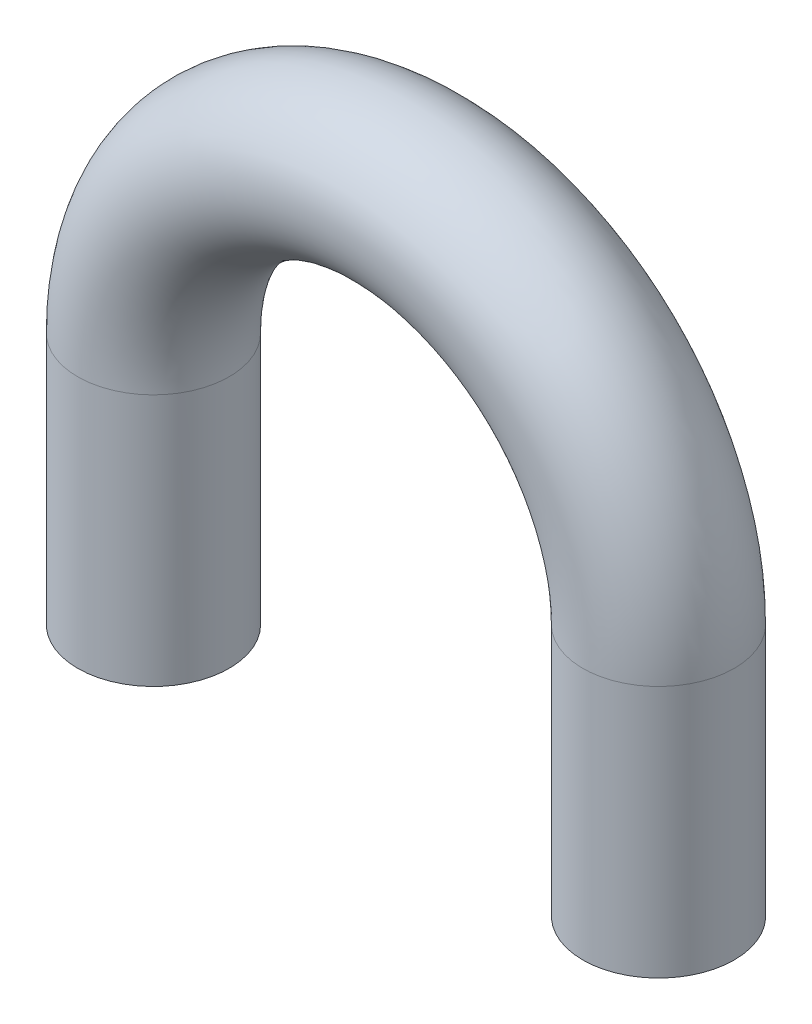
ISO-10303-21;
HEADER;
FILE_DESCRIPTION(('STEP AP214'),'2;1');
FILE_NAME('part.step','',(''),(''),'','','');
FILE_SCHEMA(('AUTOMOTIVE_DESIGN { 1 0 10303 214 1 1 1 1 }'));
ENDSEC;
DATA;
#1=APPLICATION_CONTEXT('core data for automotive mechanical design processes');
#2=APPLICATION_PROTOCOL_DEFINITION('international standard','automotive_design',2000,#1);
#3=PRODUCT_CONTEXT('',#1,'mechanical');
#4=PRODUCT('Part','Part','',(#3));
#5=PRODUCT_RELATED_PRODUCT_CATEGORY('part','',(#4));
#6=PRODUCT_DEFINITION_FORMATION('','',#4);
#7=PRODUCT_DEFINITION_CONTEXT('part definition',#1,'design');
#8=PRODUCT_DEFINITION('design','',#6,#7);
#9=PRODUCT_DEFINITION_SHAPE('','',#8);
#10=(LENGTH_UNIT() NAMED_UNIT(*) SI_UNIT(.MILLI.,.METRE.));
#11=(NAMED_UNIT(*) PLANE_ANGLE_UNIT() SI_UNIT($,.RADIAN.));
#12=(NAMED_UNIT(*) SI_UNIT($,.STERADIAN.) SOLID_ANGLE_UNIT());
#13=UNCERTAINTY_MEASURE_WITH_UNIT(LENGTH_MEASURE(1.E-05),#10,'distance_accuracy_value','');
#14=(GEOMETRIC_REPRESENTATION_CONTEXT(3) GLOBAL_UNCERTAINTY_ASSIGNED_CONTEXT((#13)) GLOBAL_UNIT_ASSIGNED_CONTEXT((#10,
#11,#12)) REPRESENTATION_CONTEXT('',''));
#15=CARTESIAN_POINT('',(0.,0.,0.));
#16=DIRECTION('',(0.,0.,1.));
#17=DIRECTION('',(1.,0.,0.));
#18=AXIS2_PLACEMENT_3D('',#15,#16,#17);
#19=CARTESIAN_POINT('',(10.,5.,0.));
#20=DIRECTION('',(0.,-1.,0.));
#21=DIRECTION('',(0.,0.,-1.));
#22=AXIS2_PLACEMENT_3D('',#19,#20,#21);
#23=CYLINDRICAL_SURFACE('',#22,1.5);
#24=CARTESIAN_POINT('',(10.,5.,0.));
#25=DIRECTION('',(0.,-1.,0.));
#26=DIRECTION('',(0.,0.,1.));
#27=AXIS2_PLACEMENT_3D('',#24,#25,#26);
#28=CIRCLE('',#27,1.5);
#29=CARTESIAN_POINT('',(11.5,5.,0.));
#30=VERTEX_POINT('',#29);
#31=EDGE_CURVE('E34',#30,#30,#28,.T.);
#32=ORIENTED_EDGE('',*,*,#31,.T.);
#33=EDGE_LOOP('',(#32));
#34=FACE_BOUND('',#33,.T.);
#35=CARTESIAN_POINT('',(10.,0.,0.));
#36=DIRECTION('',(0.,-1.,0.));
#37=DIRECTION('',(0.,0.,1.));
#38=AXIS2_PLACEMENT_3D('',#35,#36,#37);
#39=CIRCLE('',#38,1.5);
#40=CARTESIAN_POINT('',(10.,0.,1.5));
#41=VERTEX_POINT('',#40);
#42=EDGE_CURVE('E10',#41,#41,#39,.T.);
#43=ORIENTED_EDGE('',*,*,#42,.F.);
#44=EDGE_LOOP('',(#43));
#45=FACE_BOUND('',#44,.T.);
#46=ADVANCED_FACE('F28',(#34,#45),#23,.T.);
#47=CARTESIAN_POINT('',(5.,5.,0.));
#48=DIRECTION('',(0.,0.,-1.));
#49=DIRECTION('',(-1.,0.,0.));
#50=AXIS2_PLACEMENT_3D('',#47,#48,#49);
#51=TOROIDAL_SURFACE('',#50,5.,1.5);
#52=CARTESIAN_POINT('',(0.,5.,0.));
#53=DIRECTION('',(0.,1.,0.));
#54=DIRECTION('',(0.,0.,1.));
#55=AXIS2_PLACEMENT_3D('',#52,#53,#54);
#56=CIRCLE('',#55,1.5);
#57=CARTESIAN_POINT('',(-1.5,5.,0.));
#58=VERTEX_POINT('',#57);
#59=EDGE_CURVE('E38',#58,#58,#56,.T.);
#60=CARTESIAN_POINT('',(5.,5.,0.));
#61=DIRECTION('',(0.,0.,-1.));
#62=DIRECTION('',(-1.,0.,0.));
#63=AXIS2_PLACEMENT_3D('',#60,#61,#62);
#64=CIRCLE('',#63,6.5);
#65=EDGE_CURVE('',#58,#30,#64,.T.);
#66=ORIENTED_EDGE('',*,*,#59,.T.);
#67=ORIENTED_EDGE('',*,*,#31,.F.);
#68=ORIENTED_EDGE('',*,*,#65,.T.);
#69=ORIENTED_EDGE('',*,*,#65,.F.);
#70=EDGE_LOOP('',(#66,#68,#67,#69));
#71=FACE_BOUND('',#70,.T.);
#72=ADVANCED_FACE('F59',(#71),#51,.T.);
#73=CARTESIAN_POINT('',(0.,5.,0.));
#74=DIRECTION('',(0.,-1.,0.));
#75=DIRECTION('',(0.,0.,-1.));
#76=AXIS2_PLACEMENT_3D('',#73,#74,#75);
#77=CYLINDRICAL_SURFACE('',#76,1.5);
#78=ORIENTED_EDGE('',*,*,#59,.F.);
#79=EDGE_LOOP('',(#78));
#80=FACE_BOUND('',#79,.T.);
#81=CARTESIAN_POINT('',(0.,0.,0.));
#82=DIRECTION('',(0.,1.,0.));
#83=DIRECTION('',(0.,0.,1.));
#84=AXIS2_PLACEMENT_3D('',#81,#82,#83);
#85=CIRCLE('',#84,1.5);
#86=CARTESIAN_POINT('',(0.,0.,1.5));
#87=VERTEX_POINT('',#86);
#88=EDGE_CURVE('E42',#87,#87,#85,.T.);
#89=ORIENTED_EDGE('',*,*,#88,.T.);
#90=EDGE_LOOP('',(#89));
#91=FACE_BOUND('',#90,.T.);
#92=ADVANCED_FACE('F48',(#80,#91),#77,.T.);
#93=CARTESIAN_POINT('',(10.,0.,0.));
#94=DIRECTION('',(0.,-1.,0.));
#95=DIRECTION('',(0.,0.,1.));
#96=AXIS2_PLACEMENT_3D('',#93,#94,#95);
#97=PLANE('',#96);
#98=ORIENTED_EDGE('',*,*,#42,.T.);
#99=EDGE_LOOP('',(#98));
#100=FACE_BOUND('',#99,.T.);
#101=ADVANCED_FACE('F52',(#100),#97,.T.);
#102=CARTESIAN_POINT('',(0.,0.,0.));
#103=DIRECTION('',(0.,1.,0.));
#104=DIRECTION('',(0.,0.,1.));
#105=AXIS2_PLACEMENT_3D('',#102,#103,#104);
#106=PLANE('',#105);
#107=ORIENTED_EDGE('',*,*,#88,.F.);
#108=EDGE_LOOP('',(#107));
#109=FACE_BOUND('',#108,.T.);
#110=ADVANCED_FACE('F50',(#109),#106,.F.);
#111=CLOSED_SHELL('',(#46,#72,#92,#101,#110));
#112=MANIFOLD_SOLID_BREP('B2',#111);
#113=ADVANCED_BREP_SHAPE_REPRESENTATION('',(#18,#112),#14);
#114=SHAPE_DEFINITION_REPRESENTATION(#9,#113);
ENDSEC;
END-ISO-10303-21;
